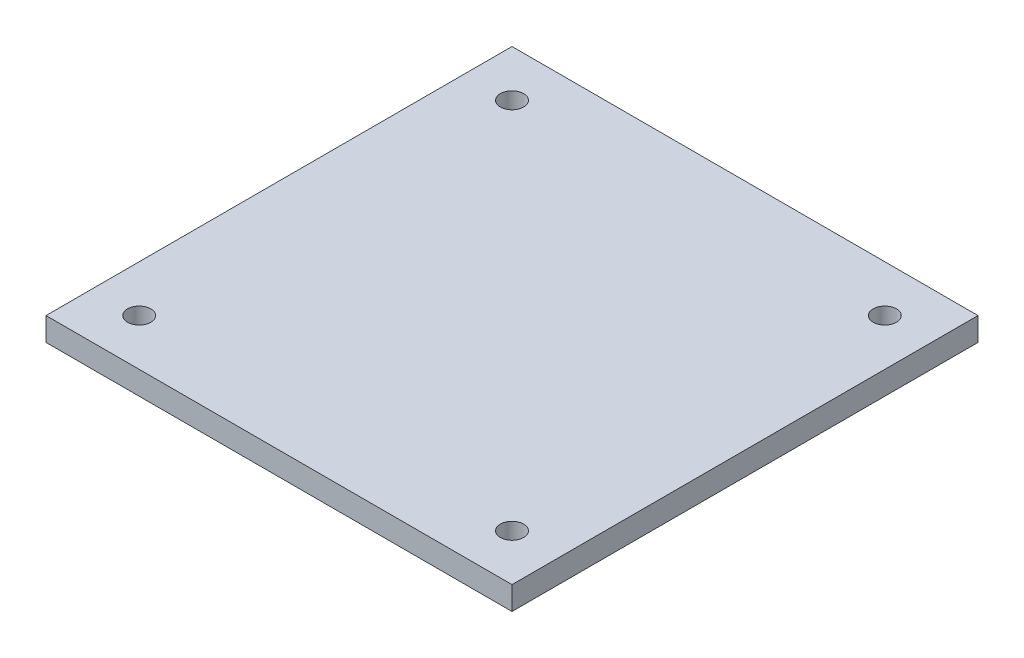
from build123d import *

# Parameters (mm, degrees)
SKETCH1_W           = 100
SKETCH1_H           = 100
BOSS_EXTRUDE1_DEPTH = 5


with BuildPart() as part:
    # Sketch1 → Boss-Extrude1 (new body)
    with BuildSketch(Plane(origin=(0, 0, 0), x_dir=(1, 0, 0), z_dir=(0, 1, 0))):
        Rectangle(SKETCH1_W, SKETCH1_H)
    extrude(amount=BOSS_EXTRUDE1_DEPTH)

    # Sketch4 → 5.0mm Dowel Hole1 (revolve, cut)
    with BuildSketch(Plane(origin=(40, 5, 40), x_dir=(0, 0, 1), z_dir=(1, 0, 0))):
        Polygon((0, 0), (0, 5), (2.525, 5), (2.5, 4.975), (2.5, 0), align=None)
    f_5_0mm_dowel_hole1 = revolve(axis=Axis((40, 11.35, 40), (0, -1, 0)), mode=Mode.SUBTRACT)

    # Mirror1: 5.0mm Dowel Hole1 across plane
    add(f_5_0mm_dowel_hole1.mirror(Plane(origin=(0, 0, 0), x_dir=(0, 0, 1), z_dir=(1, 0, 0))), mode=Mode.SUBTRACT)

    # Mirror1 at the second plane: 5.0mm Dowel Hole1 across plane
    add(f_5_0mm_dowel_hole1.mirror(Plane.XY), mode=Mode.SUBTRACT)

    # Mirror1 at the second plane copy 1 sketc → Mirror1 at the second plane copy 1 (revolve, cut)
    with BuildSketch(Plane(origin=(-40, 5, -40), x_dir=(0, 0, -1), z_dir=(-1, 0, 0))):
        Polygon((0, 0), (0, 5), (2.525, 5), (2.5, 4.975), (2.5, 0), align=None)
    revolve(axis=Axis((-40, 11.35, -40), (0, -1, 0)), mode=Mode.SUBTRACT)


solid = part.part
